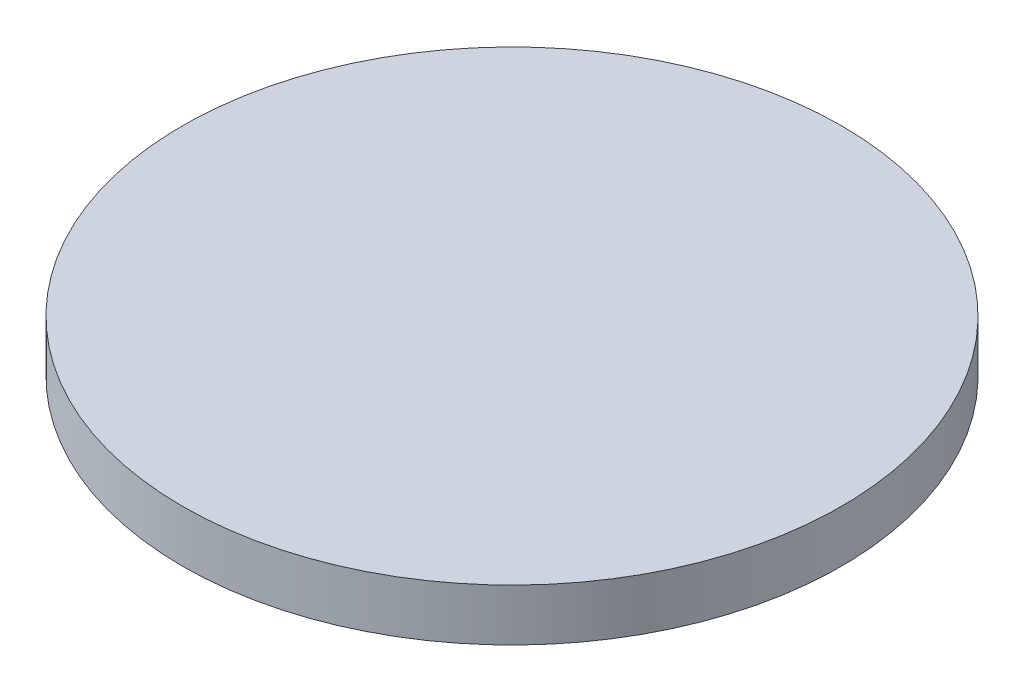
from build123d import *

# Parameters (mm, degrees)
SKETCH1_R           = 12.7
BOSS_EXTRUDE1_DEPTH = 2


with BuildPart() as part:
    # Sketch1 → Boss-Extrude1 (new body)
    with BuildSketch(Plane(origin=(0, 0, 0), x_dir=(1, 0, 0), z_dir=(0, 1, 0))):
        with Locations(Location((0, 0, 0), (0, 0, 270))):
            Circle(SKETCH1_R)
    extrude(amount=BOSS_EXTRUDE1_DEPTH)


solid = part.part
